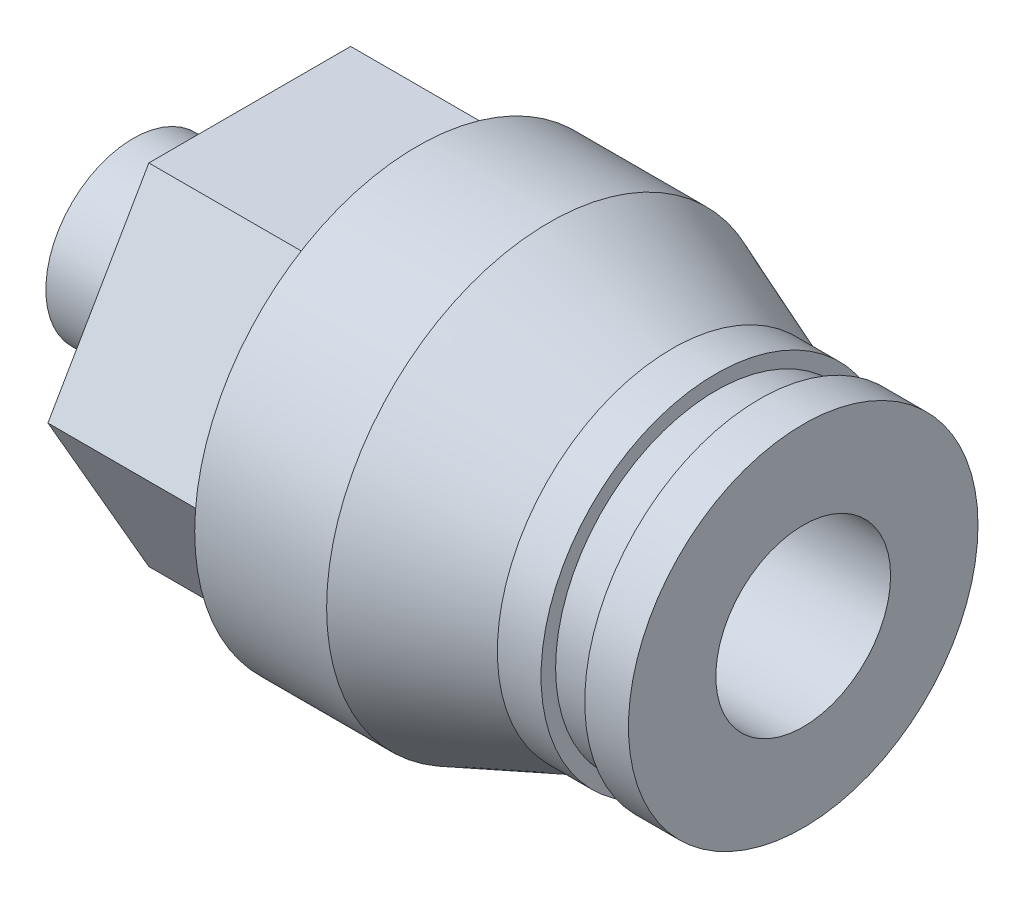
ISO-10303-21;
HEADER;
FILE_DESCRIPTION(('STEP AP214'),'2;1');
FILE_NAME('part.step','',(''),(''),'','','');
FILE_SCHEMA(('AUTOMOTIVE_DESIGN { 1 0 10303 214 1 1 1 1 }'));
ENDSEC;
DATA;
#1=APPLICATION_CONTEXT('core data for automotive mechanical design processes');
#2=APPLICATION_PROTOCOL_DEFINITION('international standard','automotive_design',2000,#1);
#3=PRODUCT_CONTEXT('',#1,'mechanical');
#4=PRODUCT('Part','Part','',(#3));
#5=PRODUCT_RELATED_PRODUCT_CATEGORY('part','',(#4));
#6=PRODUCT_DEFINITION_FORMATION('','',#4);
#7=PRODUCT_DEFINITION_CONTEXT('part definition',#1,'design');
#8=PRODUCT_DEFINITION('design','',#6,#7);
#9=PRODUCT_DEFINITION_SHAPE('','',#8);
#10=(LENGTH_UNIT() NAMED_UNIT(*) SI_UNIT(.MILLI.,.METRE.));
#11=(NAMED_UNIT(*) PLANE_ANGLE_UNIT() SI_UNIT($,.RADIAN.));
#12=(NAMED_UNIT(*) SI_UNIT($,.STERADIAN.) SOLID_ANGLE_UNIT());
#13=UNCERTAINTY_MEASURE_WITH_UNIT(LENGTH_MEASURE(1.E-05),#10,'distance_accuracy_value','');
#14=(GEOMETRIC_REPRESENTATION_CONTEXT(3) GLOBAL_UNCERTAINTY_ASSIGNED_CONTEXT((#13)) GLOBAL_UNIT_ASSIGNED_CONTEXT((#10,
#11,#12)) REPRESENTATION_CONTEXT('',''));
#15=CARTESIAN_POINT('',(0.,0.,0.));
#16=DIRECTION('',(0.,0.,1.));
#17=DIRECTION('',(1.,0.,0.));
#18=AXIS2_PLACEMENT_3D('',#15,#16,#17);
#19=CARTESIAN_POINT('',(4.,3.,0.));
#20=DIRECTION('',(-1.,0.,0.));
#21=DIRECTION('',(0.,0.,1.));
#22=AXIS2_PLACEMENT_3D('',#19,#20,#21);
#23=PLANE('',#22);
#24=CARTESIAN_POINT('',(4.,0.,0.));
#25=DIRECTION('',(1.,0.,0.));
#26=DIRECTION('',(0.,0.,-1.));
#27=AXIS2_PLACEMENT_3D('',#24,#25,#26);
#28=CIRCLE('',#27,3.);
#29=CARTESIAN_POINT('',(4.,0.,-3.));
#30=VERTEX_POINT('',#29);
#31=EDGE_CURVE('E218',#30,#30,#28,.T.);
#32=ORIENTED_EDGE('',*,*,#31,.T.);
#33=EDGE_LOOP('',(#32));
#34=FACE_BOUND('',#33,.T.);
#35=DIRECTION('',(0.,-0.866025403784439,0.5));
#36=VECTOR('',#35,1.);
#37=CARTESIAN_POINT('',(4.,0.,-6.92820323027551));
#38=LINE('',#37,#36);
#39=CARTESIAN_POINT('',(4.,0.,-6.92820323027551));
#40=VERTEX_POINT('',#39);
#41=CARTESIAN_POINT('',(4.,-6.,-3.46410161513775));
#42=VERTEX_POINT('',#41);
#43=EDGE_CURVE('E127',#40,#42,#38,.T.);
#44=ORIENTED_EDGE('',*,*,#43,.T.);
#45=DIRECTION('',(0.,0.,1.));
#46=VECTOR('',#45,1.);
#47=CARTESIAN_POINT('',(4.,-6.,-3.46410161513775));
#48=LINE('',#47,#46);
#49=CARTESIAN_POINT('',(4.,-6.,3.46410161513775));
#50=VERTEX_POINT('',#49);
#51=EDGE_CURVE('E110',#42,#50,#48,.T.);
#52=ORIENTED_EDGE('',*,*,#51,.T.);
#53=DIRECTION('',(0.,0.866025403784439,0.5));
#54=VECTOR('',#53,1.);
#55=CARTESIAN_POINT('',(4.,-6.,3.46410161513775));
#56=LINE('',#55,#54);
#57=CARTESIAN_POINT('',(4.,0.,6.92820323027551));
#58=VERTEX_POINT('',#57);
#59=EDGE_CURVE('E121',#50,#58,#56,.T.);
#60=ORIENTED_EDGE('',*,*,#59,.T.);
#61=DIRECTION('',(0.,0.866025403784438,-0.5));
#62=VECTOR('',#61,1.);
#63=CARTESIAN_POINT('',(4.,0.,6.92820323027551));
#64=LINE('',#63,#62);
#65=CARTESIAN_POINT('',(4.,6.,3.46410161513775));
#66=VERTEX_POINT('',#65);
#67=EDGE_CURVE('E30',#58,#66,#64,.T.);
#68=ORIENTED_EDGE('',*,*,#67,.T.);
#69=DIRECTION('',(0.,0.,-1.));
#70=VECTOR('',#69,1.);
#71=CARTESIAN_POINT('',(4.,6.,3.46410161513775));
#72=LINE('',#71,#70);
#73=CARTESIAN_POINT('',(4.,6.,-3.46410161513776));
#74=VERTEX_POINT('',#73);
#75=EDGE_CURVE('E131',#66,#74,#72,.T.);
#76=ORIENTED_EDGE('',*,*,#75,.T.);
#77=DIRECTION('',(0.,-0.866025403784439,-0.5));
#78=VECTOR('',#77,1.);
#79=CARTESIAN_POINT('',(4.,6.,-3.46410161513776));
#80=LINE('',#79,#78);
#81=EDGE_CURVE('E134',#74,#40,#80,.T.);
#82=ORIENTED_EDGE('',*,*,#81,.T.);
#83=EDGE_LOOP('',(#44,#52,#60,#68,#76,#82));
#84=FACE_BOUND('',#83,.T.);
#85=ADVANCED_FACE('F15',(#34,#84),#23,.T.);
#86=CARTESIAN_POINT('',(0.,0.,0.));
#87=DIRECTION('',(-1.,0.,0.));
#88=DIRECTION('',(0.,0.,1.));
#89=AXIS2_PLACEMENT_3D('',#86,#87,#88);
#90=PLANE('',#89);
#91=CARTESIAN_POINT('',(0.,0.,0.));
#92=DIRECTION('',(1.,0.,0.));
#93=DIRECTION('',(0.,0.,-1.));
#94=AXIS2_PLACEMENT_3D('',#91,#92,#93);
#95=CIRCLE('',#94,3.);
#96=CARTESIAN_POINT('',(0.,0.,-3.));
#97=VERTEX_POINT('',#96);
#98=EDGE_CURVE('E221',#97,#97,#95,.T.);
#99=ORIENTED_EDGE('',*,*,#98,.F.);
#100=EDGE_LOOP('',(#99));
#101=FACE_BOUND('',#100,.T.);
#102=DIRECTION('',(0.,-0.866025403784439,-0.5));
#103=VECTOR('',#102,1.);
#104=CARTESIAN_POINT('',(0.,0.,1.15470053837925));
#105=LINE('',#104,#103);
#106=CARTESIAN_POINT('',(0.,0.,1.15470053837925));
#107=VERTEX_POINT('',#106);
#108=CARTESIAN_POINT('',(0.,-1.,0.577350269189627));
#109=VERTEX_POINT('',#108);
#110=EDGE_CURVE('E176',#107,#109,#105,.T.);
#111=ORIENTED_EDGE('',*,*,#110,.T.);
#112=DIRECTION('',(0.,0.,-1.));
#113=VECTOR('',#112,1.);
#114=CARTESIAN_POINT('',(0.,-1.,0.577350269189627));
#115=LINE('',#114,#113);
#116=CARTESIAN_POINT('',(0.,-1.,-0.577350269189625));
#117=VERTEX_POINT('',#116);
#118=EDGE_CURVE('E38',#109,#117,#115,.T.);
#119=ORIENTED_EDGE('',*,*,#118,.T.);
#120=DIRECTION('',(0.,0.866025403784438,-0.5));
#121=VECTOR('',#120,1.);
#122=CARTESIAN_POINT('',(0.,-1.,-0.577350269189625));
#123=LINE('',#122,#121);
#124=CARTESIAN_POINT('',(0.,0.,-1.15470053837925));
#125=VERTEX_POINT('',#124);
#126=EDGE_CURVE('E164',#117,#125,#123,.T.);
#127=ORIENTED_EDGE('',*,*,#126,.T.);
#128=DIRECTION('',(0.,0.866025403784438,0.5));
#129=VECTOR('',#128,1.);
#130=CARTESIAN_POINT('',(0.,0.,-1.15470053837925));
#131=LINE('',#130,#129);
#132=CARTESIAN_POINT('',(0.,1.,-0.577350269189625));
#133=VERTEX_POINT('',#132);
#134=EDGE_CURVE('E167',#125,#133,#131,.T.);
#135=ORIENTED_EDGE('',*,*,#134,.T.);
#136=DIRECTION('',(0.,0.,1.));
#137=VECTOR('',#136,1.);
#138=CARTESIAN_POINT('',(0.,1.,-0.577350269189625));
#139=LINE('',#138,#137);
#140=CARTESIAN_POINT('',(0.,1.,0.577350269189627));
#141=VERTEX_POINT('',#140);
#142=EDGE_CURVE('E170',#133,#141,#139,.T.);
#143=ORIENTED_EDGE('',*,*,#142,.T.);
#144=DIRECTION('',(0.,-0.866025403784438,0.5));
#145=VECTOR('',#144,1.);
#146=CARTESIAN_POINT('',(0.,1.,0.577350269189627));
#147=LINE('',#146,#145);
#148=EDGE_CURVE('E173',#141,#107,#147,.T.);
#149=ORIENTED_EDGE('',*,*,#148,.T.);
#150=EDGE_LOOP('',(#111,#119,#127,#135,#143,#149));
#151=FACE_BOUND('',#150,.T.);
#152=ADVANCED_FACE('F17',(#101,#151),#90,.T.);
#153=CARTESIAN_POINT('',(6.5,3.,0.));
#154=DIRECTION('',(1.,0.,0.));
#155=DIRECTION('',(0.,0.,-1.));
#156=AXIS2_PLACEMENT_3D('',#153,#154,#155);
#157=PLANE('',#156);
#158=CARTESIAN_POINT('',(6.5,0.,0.));
#159=DIRECTION('',(1.,0.,0.));
#160=DIRECTION('',(0.,0.,-1.));
#161=AXIS2_PLACEMENT_3D('',#158,#159,#160);
#162=CIRCLE('',#161,3.);
#163=CARTESIAN_POINT('',(6.5,0.,-3.));
#164=VERTEX_POINT('',#163);
#165=EDGE_CURVE('E191',#164,#164,#162,.T.);
#166=ORIENTED_EDGE('',*,*,#165,.T.);
#167=EDGE_LOOP('',(#166));
#168=FACE_BOUND('',#167,.T.);
#169=DIRECTION('',(0.,-0.866025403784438,0.5));
#170=VECTOR('',#169,1.);
#171=CARTESIAN_POINT('',(6.5,1.75,-2.1650635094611));
#172=LINE('',#171,#170);
#173=CARTESIAN_POINT('',(6.5,0.,-1.15470053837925));
#174=VERTEX_POINT('',#173);
#175=CARTESIAN_POINT('',(6.5,-1.,-0.577350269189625));
#176=VERTEX_POINT('',#175);
#177=EDGE_CURVE('E23',#174,#176,#172,.T.);
#178=ORIENTED_EDGE('',*,*,#177,.T.);
#179=DIRECTION('',(0.,0.,1.));
#180=VECTOR('',#179,1.);
#181=CARTESIAN_POINT('',(6.5,-1.,0.));
#182=LINE('',#181,#180);
#183=CARTESIAN_POINT('',(6.5,-1.,0.577350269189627));
#184=VERTEX_POINT('',#183);
#185=EDGE_CURVE('E9',#176,#184,#182,.T.);
#186=ORIENTED_EDGE('',*,*,#185,.T.);
#187=DIRECTION('',(0.,0.866025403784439,0.5));
#188=VECTOR('',#187,1.);
#189=CARTESIAN_POINT('',(6.5,1.75,2.1650635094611));
#190=LINE('',#189,#188);
#191=CARTESIAN_POINT('',(6.5,0.,1.15470053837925));
#192=VERTEX_POINT('',#191);
#193=EDGE_CURVE('E224',#184,#192,#190,.T.);
#194=ORIENTED_EDGE('',*,*,#193,.T.);
#195=DIRECTION('',(0.,0.866025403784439,-0.5));
#196=VECTOR('',#195,1.);
#197=CARTESIAN_POINT('',(6.5,2.75,-0.433012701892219));
#198=LINE('',#197,#196);
#199=CARTESIAN_POINT('',(6.5,1.,0.577350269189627));
#200=VERTEX_POINT('',#199);
#201=EDGE_CURVE('E227',#192,#200,#198,.T.);
#202=ORIENTED_EDGE('',*,*,#201,.T.);
#203=DIRECTION('',(0.,0.,-1.));
#204=VECTOR('',#203,1.);
#205=CARTESIAN_POINT('',(6.5,1.,0.));
#206=LINE('',#205,#204);
#207=CARTESIAN_POINT('',(6.5,1.,-0.577350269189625));
#208=VERTEX_POINT('',#207);
#209=EDGE_CURVE('E230',#200,#208,#206,.T.);
#210=ORIENTED_EDGE('',*,*,#209,.T.);
#211=DIRECTION('',(0.,-0.866025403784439,-0.5));
#212=VECTOR('',#211,1.);
#213=CARTESIAN_POINT('',(6.5,2.75,0.433012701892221));
#214=LINE('',#213,#212);
#215=EDGE_CURVE('E233',#208,#174,#214,.T.);
#216=ORIENTED_EDGE('',*,*,#215,.T.);
#217=EDGE_LOOP('',(#178,#186,#194,#202,#210,#216));
#218=FACE_BOUND('',#217,.T.);
#219=ADVANCED_FACE('F237',(#168,#218),#157,.T.);
#220=CARTESIAN_POINT('',(0.,0.,0.));
#221=DIRECTION('',(1.,0.,0.));
#222=DIRECTION('',(0.,0.,-1.));
#223=AXIS2_PLACEMENT_3D('',#220,#221,#222);
#224=CYLINDRICAL_SURFACE('',#223,3.);
#225=ORIENTED_EDGE('',*,*,#98,.T.);
#226=EDGE_LOOP('',(#225));
#227=FACE_BOUND('',#226,.T.);
#228=ORIENTED_EDGE('',*,*,#31,.F.);
#229=EDGE_LOOP('',(#228));
#230=FACE_BOUND('',#229,.T.);
#231=ADVANCED_FACE('F278',(#227,#230),#224,.T.);
#232=CARTESIAN_POINT('',(0.,0.,0.));
#233=DIRECTION('',(1.,0.,0.));
#234=DIRECTION('',(0.,0.,-1.));
#235=AXIS2_PLACEMENT_3D('',#232,#233,#234);
#236=CYLINDRICAL_SURFACE('',#235,7.63975570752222);
#237=CARTESIAN_POINT('',(9.75,0.,0.));
#238=DIRECTION('',(-1.,0.,0.));
#239=DIRECTION('',(0.,0.,1.));
#240=AXIS2_PLACEMENT_3D('',#237,#238,#239);
#241=CIRCLE('',#240,7.63975570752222);
#242=CARTESIAN_POINT('',(9.75,0.,7.63975570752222));
#243=VERTEX_POINT('',#242);
#244=EDGE_CURVE('E153',#243,#243,#241,.F.);
#245=ORIENTED_EDGE('',*,*,#244,.T.);
#246=EDGE_LOOP('',(#245));
#247=FACE_BOUND('',#246,.T.);
#248=CARTESIAN_POINT('',(14.2786456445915,0.,0.));
#249=DIRECTION('',(1.,0.,0.));
#250=DIRECTION('',(0.,0.,-1.));
#251=AXIS2_PLACEMENT_3D('',#248,#249,#250);
#252=CIRCLE('',#251,7.63975570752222);
#253=CARTESIAN_POINT('',(14.2786456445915,0.,-7.63975570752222));
#254=VERTEX_POINT('',#253);
#255=EDGE_CURVE('E215',#254,#254,#252,.T.);
#256=ORIENTED_EDGE('',*,*,#255,.F.);
#257=EDGE_LOOP('',(#256));
#258=FACE_BOUND('',#257,.T.);
#259=ADVANCED_FACE('F276',(#247,#258),#236,.T.);
#260=CARTESIAN_POINT('',(18.5,0.,0.));
#261=DIRECTION('',(-1.,0.,0.));
#262=DIRECTION('',(0.,0.,1.));
#263=AXIS2_PLACEMENT_3D('',#260,#261,#262);
#264=CONICAL_SURFACE('',#263,6.,0.37050394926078);
#265=ORIENTED_EDGE('',*,*,#255,.T.);
#266=EDGE_LOOP('',(#265));
#267=FACE_BOUND('',#266,.T.);
#268=CARTESIAN_POINT('',(18.5,0.,0.));
#269=DIRECTION('',(1.,0.,0.));
#270=DIRECTION('',(0.,0.,-1.));
#271=AXIS2_PLACEMENT_3D('',#268,#269,#270);
#272=CIRCLE('',#271,6.);
#273=CARTESIAN_POINT('',(18.5,0.,-6.));
#274=VERTEX_POINT('',#273);
#275=EDGE_CURVE('E212',#274,#274,#272,.T.);
#276=ORIENTED_EDGE('',*,*,#275,.F.);
#277=EDGE_LOOP('',(#276));
#278=FACE_BOUND('',#277,.T.);
#279=ADVANCED_FACE('F285',(#267,#278),#264,.T.);
#280=CARTESIAN_POINT('',(0.,0.,0.));
#281=DIRECTION('',(1.,0.,0.));
#282=DIRECTION('',(0.,0.,-1.));
#283=AXIS2_PLACEMENT_3D('',#280,#281,#282);
#284=CYLINDRICAL_SURFACE('',#283,6.);
#285=ORIENTED_EDGE('',*,*,#275,.T.);
#286=EDGE_LOOP('',(#285));
#287=FACE_BOUND('',#286,.T.);
#288=CARTESIAN_POINT('',(20.,0.,0.));
#289=DIRECTION('',(1.,0.,0.));
#290=DIRECTION('',(0.,0.,-1.));
#291=AXIS2_PLACEMENT_3D('',#288,#289,#290);
#292=CIRCLE('',#291,6.);
#293=CARTESIAN_POINT('',(20.,0.,-6.));
#294=VERTEX_POINT('',#293);
#295=EDGE_CURVE('E209',#294,#294,#292,.T.);
#296=ORIENTED_EDGE('',*,*,#295,.F.);
#297=EDGE_LOOP('',(#296));
#298=FACE_BOUND('',#297,.T.);
#299=ADVANCED_FACE('F312',(#287,#298),#284,.T.);
#300=CARTESIAN_POINT('',(20.,6.,0.));
#301=DIRECTION('',(1.,0.,0.));
#302=DIRECTION('',(0.,0.,-1.));
#303=AXIS2_PLACEMENT_3D('',#300,#301,#302);
#304=PLANE('',#303);
#305=ORIENTED_EDGE('',*,*,#295,.T.);
#306=EDGE_LOOP('',(#305));
#307=FACE_BOUND('',#306,.T.);
#308=CARTESIAN_POINT('',(20.,0.,0.));
#309=DIRECTION('',(1.,0.,0.));
#310=DIRECTION('',(0.,0.,-1.));
#311=AXIS2_PLACEMENT_3D('',#308,#309,#310);
#312=CIRCLE('',#311,5.5);
#313=CARTESIAN_POINT('',(20.,0.,-5.5));
#314=VERTEX_POINT('',#313);
#315=EDGE_CURVE('E206',#314,#314,#312,.T.);
#316=ORIENTED_EDGE('',*,*,#315,.F.);
#317=EDGE_LOOP('',(#316));
#318=FACE_BOUND('',#317,.T.);
#319=ADVANCED_FACE('F308',(#307,#318),#304,.T.);
#320=CARTESIAN_POINT('',(0.,0.,0.));
#321=DIRECTION('',(1.,0.,0.));
#322=DIRECTION('',(0.,0.,-1.));
#323=AXIS2_PLACEMENT_3D('',#320,#321,#322);
#324=CYLINDRICAL_SURFACE('',#323,5.5);
#325=ORIENTED_EDGE('',*,*,#315,.T.);
#326=EDGE_LOOP('',(#325));
#327=FACE_BOUND('',#326,.T.);
#328=CARTESIAN_POINT('',(21.5,0.,0.));
#329=DIRECTION('',(1.,0.,0.));
#330=DIRECTION('',(0.,0.,-1.));
#331=AXIS2_PLACEMENT_3D('',#328,#329,#330);
#332=CIRCLE('',#331,5.5);
#333=CARTESIAN_POINT('',(21.5,0.,-5.5));
#334=VERTEX_POINT('',#333);
#335=EDGE_CURVE('E203',#334,#334,#332,.T.);
#336=ORIENTED_EDGE('',*,*,#335,.F.);
#337=EDGE_LOOP('',(#336));
#338=FACE_BOUND('',#337,.T.);
#339=ADVANCED_FACE('F304',(#327,#338),#324,.T.);
#340=CARTESIAN_POINT('',(21.5,5.5,0.));
#341=DIRECTION('',(-1.,0.,0.));
#342=DIRECTION('',(0.,0.,1.));
#343=AXIS2_PLACEMENT_3D('',#340,#341,#342);
#344=PLANE('',#343);
#345=ORIENTED_EDGE('',*,*,#335,.T.);
#346=EDGE_LOOP('',(#345));
#347=FACE_BOUND('',#346,.T.);
#348=CARTESIAN_POINT('',(21.5,0.,0.));
#349=DIRECTION('',(1.,0.,0.));
#350=DIRECTION('',(0.,0.,-1.));
#351=AXIS2_PLACEMENT_3D('',#348,#349,#350);
#352=CIRCLE('',#351,6.);
#353=CARTESIAN_POINT('',(21.5,0.,-6.));
#354=VERTEX_POINT('',#353);
#355=EDGE_CURVE('E200',#354,#354,#352,.T.);
#356=ORIENTED_EDGE('',*,*,#355,.F.);
#357=EDGE_LOOP('',(#356));
#358=FACE_BOUND('',#357,.T.);
#359=ADVANCED_FACE('F300',(#347,#358),#344,.T.);
#360=CARTESIAN_POINT('',(0.,0.,0.));
#361=DIRECTION('',(1.,0.,0.));
#362=DIRECTION('',(0.,0.,-1.));
#363=AXIS2_PLACEMENT_3D('',#360,#361,#362);
#364=CYLINDRICAL_SURFACE('',#363,6.);
#365=ORIENTED_EDGE('',*,*,#355,.T.);
#366=EDGE_LOOP('',(#365));
#367=FACE_BOUND('',#366,.T.);
#368=CARTESIAN_POINT('',(23.,0.,0.));
#369=DIRECTION('',(1.,0.,0.));
#370=DIRECTION('',(0.,0.,-1.));
#371=AXIS2_PLACEMENT_3D('',#368,#369,#370);
#372=CIRCLE('',#371,6.);
#373=CARTESIAN_POINT('',(23.,0.,-6.));
#374=VERTEX_POINT('',#373);
#375=EDGE_CURVE('E197',#374,#374,#372,.T.);
#376=ORIENTED_EDGE('',*,*,#375,.F.);
#377=EDGE_LOOP('',(#376));
#378=FACE_BOUND('',#377,.T.);
#379=ADVANCED_FACE('F296',(#367,#378),#364,.T.);
#380=CARTESIAN_POINT('',(23.,6.,0.));
#381=DIRECTION('',(1.,0.,0.));
#382=DIRECTION('',(0.,0.,-1.));
#383=AXIS2_PLACEMENT_3D('',#380,#381,#382);
#384=PLANE('',#383);
#385=ORIENTED_EDGE('',*,*,#375,.T.);
#386=EDGE_LOOP('',(#385));
#387=FACE_BOUND('',#386,.T.);
#388=CARTESIAN_POINT('',(23.,0.,0.));
#389=DIRECTION('',(1.,0.,0.));
#390=DIRECTION('',(0.,0.,-1.));
#391=AXIS2_PLACEMENT_3D('',#388,#389,#390);
#392=CIRCLE('',#391,3.);
#393=CARTESIAN_POINT('',(23.,0.,-3.));
#394=VERTEX_POINT('',#393);
#395=EDGE_CURVE('E194',#394,#394,#392,.T.);
#396=ORIENTED_EDGE('',*,*,#395,.F.);
#397=EDGE_LOOP('',(#396));
#398=FACE_BOUND('',#397,.T.);
#399=ADVANCED_FACE('F264',(#387,#398),#384,.T.);
#400=CARTESIAN_POINT('',(0.,0.,0.));
#401=DIRECTION('',(1.,0.,0.));
#402=DIRECTION('',(0.,0.,-1.));
#403=AXIS2_PLACEMENT_3D('',#400,#401,#402);
#404=CYLINDRICAL_SURFACE('',#403,3.);
#405=ORIENTED_EDGE('',*,*,#395,.T.);
#406=EDGE_LOOP('',(#405));
#407=FACE_BOUND('',#406,.T.);
#408=ORIENTED_EDGE('',*,*,#165,.F.);
#409=EDGE_LOOP('',(#408));
#410=FACE_BOUND('',#409,.T.);
#411=ADVANCED_FACE('F256',(#407,#410),#404,.F.);
#412=CARTESIAN_POINT('',(23.,-1.,0.577350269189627));
#413=DIRECTION('',(0.,1.,0.));
#414=DIRECTION('',(0.,0.,1.));
#415=AXIS2_PLACEMENT_3D('',#412,#413,#414);
#416=PLANE('',#415);
#417=DIRECTION('',(-1.,0.,0.));
#418=VECTOR('',#417,1.);
#419=CARTESIAN_POINT('',(23.,-1.,-0.577350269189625));
#420=LINE('',#419,#418);
#421=EDGE_CURVE('E189',#176,#117,#420,.T.);
#422=ORIENTED_EDGE('',*,*,#421,.T.);
#423=ORIENTED_EDGE('',*,*,#118,.F.);
#424=DIRECTION('',(-1.,0.,0.));
#425=VECTOR('',#424,1.);
#426=CARTESIAN_POINT('',(23.,-1.,0.577350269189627));
#427=LINE('',#426,#425);
#428=EDGE_CURVE('E179',#184,#109,#427,.T.);
#429=ORIENTED_EDGE('',*,*,#428,.F.);
#430=ORIENTED_EDGE('',*,*,#185,.F.);
#431=EDGE_LOOP('',(#422,#423,#429,#430));
#432=FACE_BOUND('',#431,.T.);
#433=ADVANCED_FACE('F254',(#432),#416,.T.);
#434=CARTESIAN_POINT('',(23.,-1.,-0.577350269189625));
#435=DIRECTION('',(0.,0.5,0.866025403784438));
#436=DIRECTION('',(0.,-0.866025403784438,0.5));
#437=AXIS2_PLACEMENT_3D('',#434,#435,#436);
#438=PLANE('',#437);
#439=DIRECTION('',(-1.,0.,0.));
#440=VECTOR('',#439,1.);
#441=CARTESIAN_POINT('',(23.,0.,-1.15470053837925));
#442=LINE('',#441,#440);
#443=EDGE_CURVE('E187',#174,#125,#442,.T.);
#444=ORIENTED_EDGE('',*,*,#443,.T.);
#445=ORIENTED_EDGE('',*,*,#126,.F.);
#446=ORIENTED_EDGE('',*,*,#421,.F.);
#447=ORIENTED_EDGE('',*,*,#177,.F.);
#448=EDGE_LOOP('',(#444,#445,#446,#447));
#449=FACE_BOUND('',#448,.T.);
#450=ADVANCED_FACE('F241',(#449),#438,.T.);
#451=CARTESIAN_POINT('',(23.,0.,-1.15470053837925));
#452=DIRECTION('',(0.,-0.5,0.866025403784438));
#453=DIRECTION('',(0.,-0.866025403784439,-0.5));
#454=AXIS2_PLACEMENT_3D('',#451,#452,#453);
#455=PLANE('',#454);
#456=DIRECTION('',(-1.,0.,0.));
#457=VECTOR('',#456,1.);
#458=CARTESIAN_POINT('',(23.,1.,-0.577350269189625));
#459=LINE('',#458,#457);
#460=EDGE_CURVE('E185',#208,#133,#459,.T.);
#461=ORIENTED_EDGE('',*,*,#460,.T.);
#462=ORIENTED_EDGE('',*,*,#134,.F.);
#463=ORIENTED_EDGE('',*,*,#443,.F.);
#464=ORIENTED_EDGE('',*,*,#215,.F.);
#465=EDGE_LOOP('',(#461,#462,#463,#464));
#466=FACE_BOUND('',#465,.T.);
#467=ADVANCED_FACE('F245',(#466),#455,.T.);
#468=CARTESIAN_POINT('',(23.,1.,-0.577350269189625));
#469=DIRECTION('',(0.,-1.,0.));
#470=DIRECTION('',(0.,0.,-1.));
#471=AXIS2_PLACEMENT_3D('',#468,#469,#470);
#472=PLANE('',#471);
#473=DIRECTION('',(-1.,0.,0.));
#474=VECTOR('',#473,1.);
#475=CARTESIAN_POINT('',(23.,1.,0.577350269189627));
#476=LINE('',#475,#474);
#477=EDGE_CURVE('E183',#200,#141,#476,.T.);
#478=ORIENTED_EDGE('',*,*,#477,.T.);
#479=ORIENTED_EDGE('',*,*,#142,.F.);
#480=ORIENTED_EDGE('',*,*,#460,.F.);
#481=ORIENTED_EDGE('',*,*,#209,.F.);
#482=EDGE_LOOP('',(#478,#479,#480,#481));
#483=FACE_BOUND('',#482,.T.);
#484=ADVANCED_FACE('F405',(#483),#472,.T.);
#485=CARTESIAN_POINT('',(23.,1.,0.577350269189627));
#486=DIRECTION('',(0.,-0.5,-0.866025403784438));
#487=DIRECTION('',(0.,0.866025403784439,-0.5));
#488=AXIS2_PLACEMENT_3D('',#485,#486,#487);
#489=PLANE('',#488);
#490=DIRECTION('',(-1.,0.,0.));
#491=VECTOR('',#490,1.);
#492=CARTESIAN_POINT('',(23.,0.,1.15470053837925));
#493=LINE('',#492,#491);
#494=EDGE_CURVE('E181',#192,#107,#493,.T.);
#495=ORIENTED_EDGE('',*,*,#494,.T.);
#496=ORIENTED_EDGE('',*,*,#148,.F.);
#497=ORIENTED_EDGE('',*,*,#477,.F.);
#498=ORIENTED_EDGE('',*,*,#201,.F.);
#499=EDGE_LOOP('',(#495,#496,#497,#498));
#500=FACE_BOUND('',#499,.T.);
#501=ADVANCED_FACE('F414',(#500),#489,.T.);
#502=CARTESIAN_POINT('',(23.,0.,1.15470053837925));
#503=DIRECTION('',(0.,0.5,-0.866025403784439));
#504=DIRECTION('',(0.,0.866025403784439,0.5));
#505=AXIS2_PLACEMENT_3D('',#502,#503,#504);
#506=PLANE('',#505);
#507=ORIENTED_EDGE('',*,*,#428,.T.);
#508=ORIENTED_EDGE('',*,*,#110,.F.);
#509=ORIENTED_EDGE('',*,*,#494,.F.);
#510=ORIENTED_EDGE('',*,*,#193,.F.);
#511=EDGE_LOOP('',(#507,#508,#509,#510));
#512=FACE_BOUND('',#511,.T.);
#513=ADVANCED_FACE('F252',(#512),#506,.T.);
#514=CARTESIAN_POINT('',(9.75,0.,0.));
#515=DIRECTION('',(-1.,0.,0.));
#516=DIRECTION('',(0.,0.,1.));
#517=AXIS2_PLACEMENT_3D('',#514,#515,#516);
#518=PLANE('',#517);
#519=ORIENTED_EDGE('',*,*,#244,.F.);
#520=EDGE_LOOP('',(#519));
#521=FACE_BOUND('',#520,.T.);
#522=DIRECTION('',(0.,-0.866025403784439,0.5));
#523=VECTOR('',#522,1.);
#524=CARTESIAN_POINT('',(9.75,0.,-6.92820323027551));
#525=LINE('',#524,#523);
#526=CARTESIAN_POINT('',(9.75,0.,-6.92820323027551));
#527=VERTEX_POINT('',#526);
#528=CARTESIAN_POINT('',(9.75,-6.,-3.46410161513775));
#529=VERTEX_POINT('',#528);
#530=EDGE_CURVE('E118',#527,#529,#525,.T.);
#531=ORIENTED_EDGE('',*,*,#530,.F.);
#532=DIRECTION('',(0.,-0.866025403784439,-0.5));
#533=VECTOR('',#532,1.);
#534=CARTESIAN_POINT('',(9.75,6.,-3.46410161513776));
#535=LINE('',#534,#533);
#536=CARTESIAN_POINT('',(9.75,6.,-3.46410161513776));
#537=VERTEX_POINT('',#536);
#538=EDGE_CURVE('E146',#537,#527,#535,.T.);
#539=ORIENTED_EDGE('',*,*,#538,.F.);
#540=DIRECTION('',(0.,0.,-1.));
#541=VECTOR('',#540,1.);
#542=CARTESIAN_POINT('',(9.75,6.,3.46410161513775));
#543=LINE('',#542,#541);
#544=CARTESIAN_POINT('',(9.75,6.,3.46410161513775));
#545=VERTEX_POINT('',#544);
#546=EDGE_CURVE('E143',#545,#537,#543,.T.);
#547=ORIENTED_EDGE('',*,*,#546,.F.);
#548=DIRECTION('',(0.,0.866025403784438,-0.5));
#549=VECTOR('',#548,1.);
#550=CARTESIAN_POINT('',(9.75,0.,6.92820323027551));
#551=LINE('',#550,#549);
#552=CARTESIAN_POINT('',(9.75,0.,6.92820323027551));
#553=VERTEX_POINT('',#552);
#554=EDGE_CURVE('E140',#553,#545,#551,.T.);
#555=ORIENTED_EDGE('',*,*,#554,.F.);
#556=DIRECTION('',(0.,0.866025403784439,0.5));
#557=VECTOR('',#556,1.);
#558=CARTESIAN_POINT('',(9.75,-6.,3.46410161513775));
#559=LINE('',#558,#557);
#560=CARTESIAN_POINT('',(9.75,-6.,3.46410161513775));
#561=VERTEX_POINT('',#560);
#562=EDGE_CURVE('E138',#561,#553,#559,.T.);
#563=ORIENTED_EDGE('',*,*,#562,.F.);
#564=DIRECTION('',(0.,0.,1.));
#565=VECTOR('',#564,1.);
#566=CARTESIAN_POINT('',(9.75,-6.,-3.46410161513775));
#567=LINE('',#566,#565);
#568=EDGE_CURVE('E113',#529,#561,#567,.T.);
#569=ORIENTED_EDGE('',*,*,#568,.F.);
#570=EDGE_LOOP('',(#531,#539,#547,#555,#563,#569));
#571=FACE_BOUND('',#570,.T.);
#572=ADVANCED_FACE('F433',(#521,#571),#518,.T.);
#573=CARTESIAN_POINT('',(9.75,-6.,-3.46410161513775));
#574=DIRECTION('',(0.,-1.,0.));
#575=DIRECTION('',(0.,0.,-1.));
#576=AXIS2_PLACEMENT_3D('',#573,#574,#575);
#577=PLANE('',#576);
#578=DIRECTION('',(-1.,0.,0.));
#579=VECTOR('',#578,1.);
#580=CARTESIAN_POINT('',(9.75,-6.,-3.46410161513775));
#581=LINE('',#580,#579);
#582=EDGE_CURVE('E151',#529,#42,#581,.T.);
#583=ORIENTED_EDGE('',*,*,#582,.F.);
#584=ORIENTED_EDGE('',*,*,#568,.T.);
#585=DIRECTION('',(-1.,0.,0.));
#586=VECTOR('',#585,1.);
#587=CARTESIAN_POINT('',(9.75,-6.,3.46410161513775));
#588=LINE('',#587,#586);
#589=EDGE_CURVE('E106',#561,#50,#588,.T.);
#590=ORIENTED_EDGE('',*,*,#589,.T.);
#591=ORIENTED_EDGE('',*,*,#51,.F.);
#592=EDGE_LOOP('',(#583,#584,#590,#591));
#593=FACE_BOUND('',#592,.T.);
#594=ADVANCED_FACE('F108',(#593),#577,.T.);
#595=CARTESIAN_POINT('',(9.75,0.,-6.92820323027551));
#596=DIRECTION('',(0.,-0.5,-0.866025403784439));
#597=DIRECTION('',(0.,0.866025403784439,-0.5));
#598=AXIS2_PLACEMENT_3D('',#595,#596,#597);
#599=PLANE('',#598);
#600=DIRECTION('',(-1.,0.,0.));
#601=VECTOR('',#600,1.);
#602=CARTESIAN_POINT('',(9.75,0.,-6.92820323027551));
#603=LINE('',#602,#601);
#604=EDGE_CURVE('E154',#527,#40,#603,.T.);
#605=ORIENTED_EDGE('',*,*,#604,.F.);
#606=ORIENTED_EDGE('',*,*,#530,.T.);
#607=ORIENTED_EDGE('',*,*,#582,.T.);
#608=ORIENTED_EDGE('',*,*,#43,.F.);
#609=EDGE_LOOP('',(#605,#606,#607,#608));
#610=FACE_BOUND('',#609,.T.);
#611=ADVANCED_FACE('F451',(#610),#599,.T.);
#612=CARTESIAN_POINT('',(9.75,6.,-3.46410161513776));
#613=DIRECTION('',(0.,0.5,-0.866025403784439));
#614=DIRECTION('',(0.,0.866025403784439,0.5));
#615=AXIS2_PLACEMENT_3D('',#612,#613,#614);
#616=PLANE('',#615);
#617=DIRECTION('',(-1.,0.,0.));
#618=VECTOR('',#617,1.);
#619=CARTESIAN_POINT('',(9.75,6.,-3.46410161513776));
#620=LINE('',#619,#618);
#621=EDGE_CURVE('E156',#537,#74,#620,.T.);
#622=ORIENTED_EDGE('',*,*,#621,.F.);
#623=ORIENTED_EDGE('',*,*,#538,.T.);
#624=ORIENTED_EDGE('',*,*,#604,.T.);
#625=ORIENTED_EDGE('',*,*,#81,.F.);
#626=EDGE_LOOP('',(#622,#623,#624,#625));
#627=FACE_BOUND('',#626,.T.);
#628=ADVANCED_FACE('F460',(#627),#616,.T.);
#629=CARTESIAN_POINT('',(9.75,6.,3.46410161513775));
#630=DIRECTION('',(0.,1.,0.));
#631=DIRECTION('',(0.,0.,1.));
#632=AXIS2_PLACEMENT_3D('',#629,#630,#631);
#633=PLANE('',#632);
#634=DIRECTION('',(-1.,0.,0.));
#635=VECTOR('',#634,1.);
#636=CARTESIAN_POINT('',(9.75,6.,3.46410161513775));
#637=LINE('',#636,#635);
#638=EDGE_CURVE('E158',#545,#66,#637,.T.);
#639=ORIENTED_EDGE('',*,*,#638,.F.);
#640=ORIENTED_EDGE('',*,*,#546,.T.);
#641=ORIENTED_EDGE('',*,*,#621,.T.);
#642=ORIENTED_EDGE('',*,*,#75,.F.);
#643=EDGE_LOOP('',(#639,#640,#641,#642));
#644=FACE_BOUND('',#643,.T.);
#645=ADVANCED_FACE('F470',(#644),#633,.T.);
#646=CARTESIAN_POINT('',(9.75,0.,6.92820323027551));
#647=DIRECTION('',(0.,0.5,0.866025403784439));
#648=DIRECTION('',(0.,-0.866025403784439,0.5));
#649=AXIS2_PLACEMENT_3D('',#646,#647,#648);
#650=PLANE('',#649);
#651=DIRECTION('',(-1.,0.,0.));
#652=VECTOR('',#651,1.);
#653=CARTESIAN_POINT('',(9.75,0.,6.92820323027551));
#654=LINE('',#653,#652);
#655=EDGE_CURVE('E117',#553,#58,#654,.T.);
#656=ORIENTED_EDGE('',*,*,#655,.F.);
#657=ORIENTED_EDGE('',*,*,#554,.T.);
#658=ORIENTED_EDGE('',*,*,#638,.T.);
#659=ORIENTED_EDGE('',*,*,#67,.F.);
#660=EDGE_LOOP('',(#656,#657,#658,#659));
#661=FACE_BOUND('',#660,.T.);
#662=ADVANCED_FACE('F480',(#661),#650,.T.);
#663=CARTESIAN_POINT('',(9.75,-6.,3.46410161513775));
#664=DIRECTION('',(0.,-0.5,0.866025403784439));
#665=DIRECTION('',(0.,-0.866025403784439,-0.5));
#666=AXIS2_PLACEMENT_3D('',#663,#664,#665);
#667=PLANE('',#666);
#668=ORIENTED_EDGE('',*,*,#589,.F.);
#669=ORIENTED_EDGE('',*,*,#562,.T.);
#670=ORIENTED_EDGE('',*,*,#655,.T.);
#671=ORIENTED_EDGE('',*,*,#59,.F.);
#672=EDGE_LOOP('',(#668,#669,#670,#671));
#673=FACE_BOUND('',#672,.T.);
#674=ADVANCED_FACE('F122',(#673),#667,.T.);
#675=CLOSED_SHELL('',(#85,#152,#219,#231,#259,#279,#299,#319,#339,#359,#379,#399,#411,#433,#450,
#467,#484,#501,#513,#572,#594,#611,#628,#645,#662,#674));
#676=MANIFOLD_SOLID_BREP('B1',#675);
#677=ADVANCED_BREP_SHAPE_REPRESENTATION('',(#18,#676),#14);
#678=SHAPE_DEFINITION_REPRESENTATION(#9,#677);
ENDSEC;
END-ISO-10303-21;
